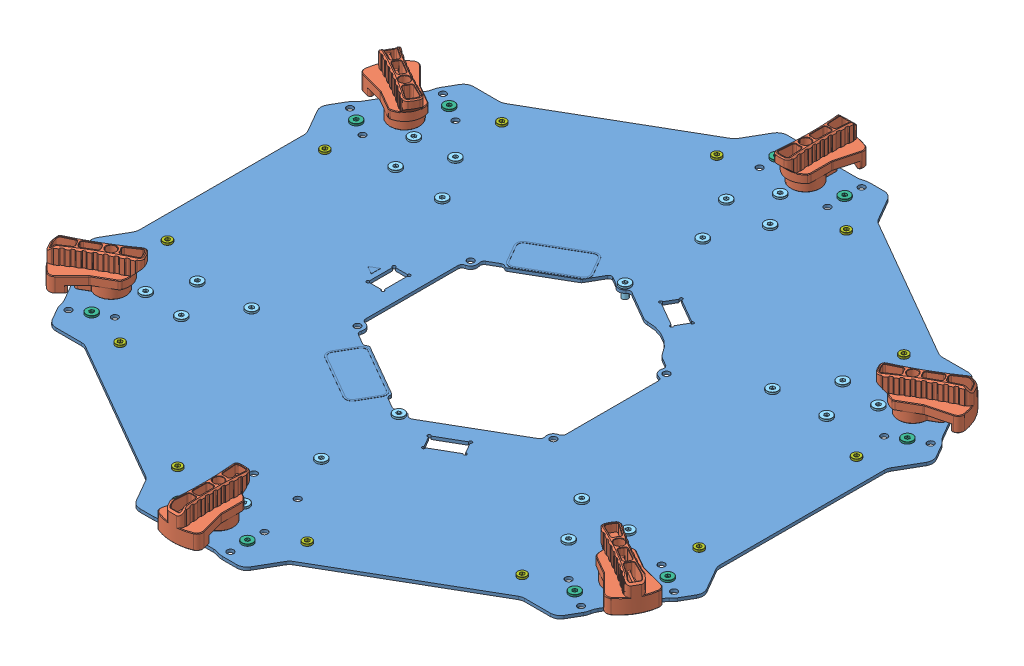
SolidWorks assembly M600 BASE_1-17.sldasm, configuration Default (file format 9000). Lengths in mm.
Overall size (305.57 23.51 339.22).
79 component instances, 8 part files, 0 mates.
Components (placement in the parent):
- D600 BASE_1-171-1: D600 BASE_1-171.sldprt [Default] at (0 1.5 0) x (-1 0 0) z (0 -1 0) size (305.57 323.32 1.6)
- D600 BASE_1-172-1: D600 BASE_1-172.sldprt [Default] at (126.9663 6.5 73.304) x (-0.5 0 0.866025) z (-0.866025 0 -0.5) size (21.21 17.01 36)
- M600 BASE_1-173-1: M600 BASE_1-173.sldasm [Default] at (126.9663 0 73.304) x (0.5 0 -0.866025) z (0 1 0) size (14.04 14.04 10)
  - D600 BASE_1-1731-1: D600 BASE_1-1731.sldprt [Default] at origin size (14.04 14.04 10)
  - D600 BASE_1-1732-1: D600 BASE_1-1732.sldprt [Default] x (-1 0 0) z (0 1 0) size (5.5 4 5.5)
- D600 BASE_1-09-1: D600 BASE_1-09.sldprt [Default] at (116.0474 2.5 67) x (0.909579 0 0.415532) z (0 -1 0) size (5.5 5.5 6.5)
- D600 BASE_1-09-2: D600 BASE_1-09.sldprt [Default] at (107.6635 2.5 49.5214) x (0.251436 0 0.967874) z (0 -1 0) size (5.5 5.5 6.5)
- D600 BASE_1-09-3: D600 BASE_1-09.sldprt [Default] at (96.7185 2.5 68.4786) x (0.909579 0 0.415532) z (0 -1 0) size (5.5 5.5 6.5)
- D600 BASE_1-09-4: D600 BASE_1-09.sldprt [Default] at (82.4889 2.5 47.625) x (0.251436 0 0.967874) z (0 -1 0) size (5.5 5.5 6.5)
- D600 BASE_1-09-5: D600 BASE_1-09.sldprt [Default] at (82.4889 2.5 -47.625) x (0.963921 0 0.266187) z (0 -1 0) size (5.5 5.5 6.5)
- D600 BASE_1-09-6: D600 BASE_1-09.sldprt [Default] at (0 2.5 -95.25) x (0.712485 0 -0.701687) z (0 -1 0) size (5.5 5.5 6.5)
- D600 BASE_1-09-7: D600 BASE_1-09.sldprt [Default] at (-82.4889 2.5 -47.625) x (-0.251436 0 -0.967874) z (0 -1 0) size (5.5 5.5 6.5)
- D600 BASE_1-09-8: D600 BASE_1-09.sldprt [Default] at (-82.4889 2.5 47.625) x (-0.963921 0 -0.266187) z (0 -1 0) size (5.5 5.5 6.5)
- D600 BASE_1-09-9: D600 BASE_1-09.sldprt [Default] at (107.6635 2.5 -49.5214) x (0.81465 0 -0.579952) z (0 -1 0) size (5.5 5.5 6.5)
- D600 BASE_1-09-10: D600 BASE_1-09.sldprt [Default] at (10.945 2.5 -118) x (-0.094928 0 -0.995484) z (0 -1 0) size (5.5 5.5 6.5)
- D600 BASE_1-09-11: D600 BASE_1-09.sldprt [Default] at (-96.7185 2.5 -68.4786) x (-0.909579 0 -0.415532) z (0 -1 0) size (5.5 5.5 6.5)
- D600 BASE_1-09-12: D600 BASE_1-09.sldprt [Default] at (-107.6635 2.5 49.5214) x (-0.81465 0 0.579952) z (0 -1 0) size (5.5 5.5 6.5)
- D600 BASE_1-09-13: D600 BASE_1-09.sldprt [Default] at (96.7185 2.5 -68.4786) x (0.963921 0 0.266187) z (0 -1 0) size (5.5 5.5 6.5)
- D600 BASE_1-09-14: D600 BASE_1-09.sldprt [Default] at (-10.945 2.5 -118) x (0.712485 0 -0.701687) z (0 -1 0) size (5.5 5.5 6.5)
- D600 BASE_1-09-15: D600 BASE_1-09.sldprt [Default] at (-107.6635 2.5 -49.5214) x (-0.251436 0 -0.967874) z (0 -1 0) size (5.5 5.5 6.5)
- D600 BASE_1-09-16: D600 BASE_1-09.sldprt [Default] at (-96.7185 2.5 68.4786) x (-0.963921 0 -0.266187) z (0 -1 0) size (5.5 5.5 6.5)
- D600 BASE_1-09-17: D600 BASE_1-09.sldprt [Default] at (116.0474 2.5 -67) x (0.81465 0 -0.579952) z (0 -1 0) size (5.5 5.5 6.5)
- D600 BASE_1-09-18: D600 BASE_1-09.sldprt [Default] at (0 2.5 -134) x (-0.094928 0 -0.995484) z (0 -1 0) size (5.5 5.5 6.5)
- D600 BASE_1-09-19: D600 BASE_1-09.sldprt [Default] at (-116.0474 2.5 -67) x (-0.909579 0 -0.415532) z (0 -1 0) size (5.5 5.5 6.5)
- D600 BASE_1-09-20: D600 BASE_1-09.sldprt [Default] at (-116.0474 2.5 67) x (-0.81465 0 0.579952) z (0 -1 0) size (5.5 5.5 6.5)
- D600 BASE_1-09-21: D600 BASE_1-09.sldprt [Default] at (0 2.5 56.5) x (-0.97557 0 0.219688) z (0 -1 0) size (5.5 5.5 6.5)
- D600 BASE_1-09-22: D600 BASE_1-09.sldprt [Default] at (0 2.5 -56.5) x (0.61691 0 -0.787034) z (0 -1 0) size (5.5 5.5 6.5)
- D600 BASE_3-12-1: D600 BASE_3-12.sldprt [Default] at (120.6747 2.5 89.3015) x (0.968492 0 0.249044) z (0 -1 0) size (5.5 5.5 7.5)
- D600 BASE_3-12-2: D600 BASE_3-12.sldprt [Default] at (137.6747 2.5 59.8566) x (0.993341 0 0.115207) z (0 -1 0) size (5.5 5.5 7.5)
- D600 BASE_3-12-3: D600 BASE_3-12.sldprt [Default] at (120.6747 2.5 -89.3015) x (0.596443 0 -0.802655) z (0 -1 0) size (5.5 5.5 7.5)
- D600 BASE_3-12-4: D600 BASE_3-12.sldprt [Default] at (-17 2.5 -149.1581) x (-0.396898 0 -0.917863) z (0 -1 0) size (5.5 5.5 7.5)
- D600 BASE_3-12-5: D600 BASE_3-12.sldprt [Default] at (-137.6747 2.5 -59.8566) x (-0.993341 0 -0.115207) z (0 -1 0) size (5.5 5.5 7.5)
- D600 BASE_3-12-6: D600 BASE_3-12.sldprt [Default] at (-120.6747 2.5 89.3015) x (-0.596443 0 0.802655) z (0 -1 0) size (5.5 5.5 7.5)
- D600 BASE_3-12-7: D600 BASE_3-12.sldprt [Default] at (17 2.5 149.1581) x (0.396898 0 0.917863) z (0 -1 0) size (5.5 5.5 7.5)
- D600 BASE_3-12-8: D600 BASE_3-12.sldprt [Default] at (137.6747 2.5 -59.8566) x (0.699925 0 -0.714217) z (0 -1 0) size (5.5 5.5 7.5)
- D600 BASE_3-12-9: D600 BASE_3-12.sldprt [Default] at (17 2.5 -149.1581) x (-0.268567 0 -0.963261) z (0 -1 0) size (5.5 5.5 7.5)
- D600 BASE_3-12-10: D600 BASE_3-12.sldprt [Default] at (-120.6747 2.5 -89.3015) x (-0.968492 0 -0.249044) z (0 -1 0) size (5.5 5.5 7.5)
- D600 BASE_3-12-11: D600 BASE_3-12.sldprt [Default] at (-137.6747 2.5 59.8566) x (-0.699925 0 0.714217) z (0 -1 0) size (5.5 5.5 7.5)
- D600 BASE_3-12-12: D600 BASE_3-12.sldprt [Default] at (-17 2.5 149.1581) x (0.268567 0 0.963261) z (0 -1 0) size (5.5 5.5 7.5)
- D600 BASE_1-09-23: D600 BASE_1-09.sldprt [Default] at (0 2.5 95.25) x (0.909579 0 0.415532) z (0 -1 0) size (5.5 5.5 6.5)
- D600 BASE_1-09-24: D600 BASE_1-09.sldprt [Default] at (0 2.5 134) x (0.909579 0 0.415532) z (0 -1 0) size (5.5 5.5 6.5)
- D600 BASE_1-10-1: D600 BASE_1-10.sldprt [Default] at (100.4348 -4.2 95.3582) x (0.093026 0 0.995664) z (0 1 0) size (4.45 4.45 6.8)
- D600 BASE_1-10-2: D600 BASE_1-10.sldprt [Default] at (32.3652 -4.2 134.6582) x (0.093026 0 0.995664) z (0 1 0) size (4.45 4.45 6.8)
- D600 BASE_1-10-3: D600 BASE_1-10.sldprt [Default] at (132.8 -4.2 -39.3) x (0.908783 0 0.417269) z (0 1 0) size (4.45 4.45 6.8)
- D600 BASE_1-10-4: D600 BASE_1-10.sldprt [Default] at (32.3652 -4.2 -134.6582) x (0.815757 0 -0.578395) z (0 1 0) size (4.45 4.45 6.8)
- D600 BASE_1-10-5: D600 BASE_1-10.sldprt [Default] at (-100.4348 -4.2 -95.3582) x (-0.093026 0 -0.995664) z (0 1 0) size (4.45 4.45 6.8)
- D600 BASE_1-10-6: D600 BASE_1-10.sldprt [Default] at (-132.8 -4.2 39.3) x (-0.908783 0 -0.417269) z (0 1 0) size (4.45 4.45 6.8)
- D600 BASE_1-10-7: D600 BASE_1-10.sldprt [Default] at (-32.3652 -4.2 134.6582) x (-0.815757 0 0.578395) z (0 1 0) size (4.45 4.45 6.8)
- D600 BASE_1-10-8: D600 BASE_1-10.sldprt [Default] at (132.8 -4.2 39.3) x (0.908783 0 0.417269) z (0 1 0) size (4.45 4.45 6.8)
- D600 BASE_1-10-9: D600 BASE_1-10.sldprt [Default] at (100.4348 -4.2 -95.3582) x (0.815757 0 -0.578395) z (0 1 0) size (4.45 4.45 6.8)
- D600 BASE_1-10-10: D600 BASE_1-10.sldprt [Default] at (-32.3652 -4.2 -134.6582) x (-0.093026 0 -0.995664) z (0 1 0) size (4.45 4.45 6.8)
- D600 BASE_1-10-11: D600 BASE_1-10.sldprt [Default] at (-132.8 -4.2 -39.3) x (-0.908783 0 -0.417269) z (0 1 0) size (4.45 4.45 6.8)
- D600 BASE_1-10-12: D600 BASE_1-10.sldprt [Default] at (-100.4348 -4.2 95.3582) x (-0.815757 0 0.578395) z (0 1 0) size (4.45 4.45 6.8)
- D600 BASE_1-174-1: D600 BASE_1-174.sldprt [Default] at (126.9663 -1.5 73.304) x (0.821938 0 0.569576) z (0 1 0) size (4.7 4.7 13.2)
- D600 BASE_1-174-2: D600 BASE_1-174.sldprt [Default] at (126.9663 -1.5 -73.304) x (0.904237 0 -0.427031) z (0 1 0) size (4.7 4.7 13.2)
- D600 BASE_1-174-3: D600 BASE_1-174.sldprt [Default] at (0 -1.5 -146.6081) x (0.082298 0 -0.996608) z (0 1 0) size (4.7 4.7 13.2)
- D600 BASE_1-174-4: D600 BASE_1-174.sldprt [Default] at (-126.9663 -1.5 -73.304) x (-0.821938 0 -0.569576) z (0 1 0) size (4.7 4.7 13.2)
- D600 BASE_1-174-5: D600 BASE_1-174.sldprt [Default] at (-126.9663 -1.5 73.304) x (-0.904237 0 0.427031) z (0 1 0) size (4.7 4.7 13.2)
- D600 BASE_1-174-6: D600 BASE_1-174.sldprt [Default] at (0 -1.5 146.6081) x (-0.082298 0 0.996608) z (0 1 0) size (4.7 4.7 13.2)
- M600 BASE_1-173-2: M600 BASE_1-173.sldasm [Default] at (126.9663 0 -73.304) x (-0.5 0 -0.866025) z (0 1 0) size (14.04 14.04 10)
  - D600 BASE_1-1731-1: D600 BASE_1-1731.sldprt [Default] at origin size (14.04 14.04 10)
  - D600 BASE_1-1732-1: D600 BASE_1-1732.sldprt [Default] x (-1 0 0) z (0 1 0) size (5.5 4 5.5)
- M600 BASE_1-173-3: M600 BASE_1-173.sldasm [Default] at (0 0 -146.6081) x (-1 0 0) z (0 1 0) size (14.04 14.04 10)
  - D600 BASE_1-1731-1: D600 BASE_1-1731.sldprt [Default] at origin size (14.04 14.04 10)
  - D600 BASE_1-1732-1: D600 BASE_1-1732.sldprt [Default] x (-1 0 0) z (0 1 0) size (5.5 4 5.5)
- M600 BASE_1-173-4: M600 BASE_1-173.sldasm [Default] at (-126.9663 0 -73.304) x (-0.5 0 0.866025) z (0 1 0) size (14.04 14.04 10)
  - D600 BASE_1-1731-1: D600 BASE_1-1731.sldprt [Default] at origin size (14.04 14.04 10)
  - D600 BASE_1-1732-1: D600 BASE_1-1732.sldprt [Default] x (-1 0 0) z (0 1 0) size (5.5 4 5.5)
- M600 BASE_1-173-5: M600 BASE_1-173.sldasm [Default] at (-126.9663 0 73.304) x (0.5 0 0.866025) z (0 1 0) size (14.04 14.04 10)
  - D600 BASE_1-1731-1: D600 BASE_1-1731.sldprt [Default] at origin size (14.04 14.04 10)
  - D600 BASE_1-1732-1: D600 BASE_1-1732.sldprt [Default] x (-1 0 0) z (0 1 0) size (5.5 4 5.5)
- M600 BASE_1-173-6: M600 BASE_1-173.sldasm [Default] at (0 0 146.6081) x (1 0 0) z (0 1 0) size (14.04 14.04 10)
  - D600 BASE_1-1731-1: D600 BASE_1-1731.sldprt [Default] at origin size (14.04 14.04 10)
  - D600 BASE_1-1732-1: D600 BASE_1-1732.sldprt [Default] x (-1 0 0) z (0 1 0) size (5.5 4 5.5)
- D600 BASE_1-172-2: D600 BASE_1-172.sldprt [Default] at (126.9663 6.5 -73.304) x (0.5 0 0.866025) z (-0.866025 0 0.5) size (21.21 17.01 36)
- D600 BASE_1-172-3: D600 BASE_1-172.sldprt [Default] at (0 6.5 -146.6081) size (21.21 17.01 36)
- D600 BASE_1-172-4: D600 BASE_1-172.sldprt [Default] at (-126.9663 6.5 -73.304) x (0.5 0 -0.866025) z (0.866025 0 0.5) size (21.21 17.01 36)
- D600 BASE_1-172-5: D600 BASE_1-172.sldprt [Default] at (-126.9663 6.5 73.304) x (-0.5 0 -0.866025) z (0.866025 0 -0.5) size (21.21 17.01 36)
- D600 BASE_1-172-6: D600 BASE_1-172.sldprt [Default] at (0 6.5 146.6081) x (-1 0 0) z (0 0 -1) size (21.21 17.01 36)
